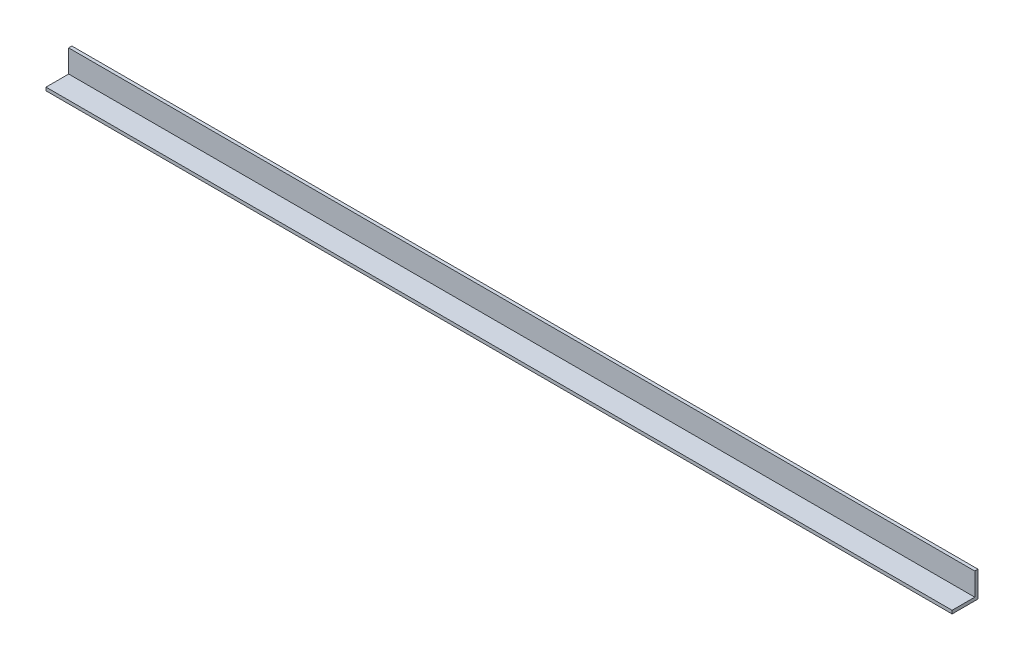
ISO-10303-21;
HEADER;
FILE_DESCRIPTION(('STEP AP214'),'2;1');
FILE_NAME('part.step','',(''),(''),'','','');
FILE_SCHEMA(('AUTOMOTIVE_DESIGN { 1 0 10303 214 1 1 1 1 }'));
ENDSEC;
DATA;
#1=APPLICATION_CONTEXT('core data for automotive mechanical design processes');
#2=APPLICATION_PROTOCOL_DEFINITION('international standard','automotive_design',2000,#1);
#3=PRODUCT_CONTEXT('',#1,'mechanical');
#4=PRODUCT('Part','Part','',(#3));
#5=PRODUCT_RELATED_PRODUCT_CATEGORY('part','',(#4));
#6=PRODUCT_DEFINITION_FORMATION('','',#4);
#7=PRODUCT_DEFINITION_CONTEXT('part definition',#1,'design');
#8=PRODUCT_DEFINITION('design','',#6,#7);
#9=PRODUCT_DEFINITION_SHAPE('','',#8);
#10=(LENGTH_UNIT() NAMED_UNIT(*) SI_UNIT(.MILLI.,.METRE.));
#11=(NAMED_UNIT(*) PLANE_ANGLE_UNIT() SI_UNIT($,.RADIAN.));
#12=(NAMED_UNIT(*) SI_UNIT($,.STERADIAN.) SOLID_ANGLE_UNIT());
#13=UNCERTAINTY_MEASURE_WITH_UNIT(LENGTH_MEASURE(1.E-05),#10,'distance_accuracy_value','');
#14=(GEOMETRIC_REPRESENTATION_CONTEXT(3) GLOBAL_UNCERTAINTY_ASSIGNED_CONTEXT((#13)) GLOBAL_UNIT_ASSIGNED_CONTEXT((#10,
#11,#12)) REPRESENTATION_CONTEXT('',''));
#15=CARTESIAN_POINT('',(0.,0.,0.));
#16=DIRECTION('',(0.,0.,1.));
#17=DIRECTION('',(1.,0.,0.));
#18=AXIS2_PLACEMENT_3D('',#15,#16,#17);
#19=CARTESIAN_POINT('',(444.5,3.175,-12.7));
#20=DIRECTION('',(-1.,0.,0.));
#21=DIRECTION('',(0.,0.,1.));
#22=AXIS2_PLACEMENT_3D('',#19,#20,#21);
#23=PLANE('',#22);
#24=DIRECTION('',(0.,0.,-1.));
#25=VECTOR('',#24,1.);
#26=CARTESIAN_POINT('',(444.5,0.,-12.7));
#27=LINE('',#26,#25);
#28=CARTESIAN_POINT('',(444.5,0.,12.7));
#29=VERTEX_POINT('',#28);
#30=CARTESIAN_POINT('',(444.5,0.,-12.7));
#31=VERTEX_POINT('',#30);
#32=EDGE_CURVE('E90',#29,#31,#27,.T.);
#33=ORIENTED_EDGE('',*,*,#32,.T.);
#34=DIRECTION('',(0.,-1.,0.));
#35=VECTOR('',#34,1.);
#36=CARTESIAN_POINT('',(444.5,3.175,-12.7));
#37=LINE('',#36,#35);
#38=CARTESIAN_POINT('',(444.5,25.4,-12.7));
#39=VERTEX_POINT('',#38);
#40=EDGE_CURVE('E11',#39,#31,#37,.T.);
#41=ORIENTED_EDGE('',*,*,#40,.F.);
#42=DIRECTION('',(0.,0.,-1.));
#43=VECTOR('',#42,1.);
#44=CARTESIAN_POINT('',(444.5,25.4,-9.525));
#45=LINE('',#44,#43);
#46=CARTESIAN_POINT('',(444.5,25.4,-9.525));
#47=VERTEX_POINT('',#46);
#48=EDGE_CURVE('E116',#47,#39,#45,.T.);
#49=ORIENTED_EDGE('',*,*,#48,.F.);
#50=DIRECTION('',(0.,-1.,0.));
#51=VECTOR('',#50,1.);
#52=CARTESIAN_POINT('',(444.5,25.4,-9.525));
#53=LINE('',#52,#51);
#54=CARTESIAN_POINT('',(444.5,3.175,-9.525));
#55=VERTEX_POINT('',#54);
#56=EDGE_CURVE('E99',#47,#55,#53,.T.);
#57=ORIENTED_EDGE('',*,*,#56,.T.);
#58=DIRECTION('',(0.,0.,-1.));
#59=VECTOR('',#58,1.);
#60=CARTESIAN_POINT('',(444.5,3.175,-12.7));
#61=LINE('',#60,#59);
#62=CARTESIAN_POINT('',(444.5,3.175,12.7));
#63=VERTEX_POINT('',#62);
#64=EDGE_CURVE('E84',#63,#55,#61,.T.);
#65=ORIENTED_EDGE('',*,*,#64,.F.);
#66=DIRECTION('',(0.,-1.,0.));
#67=VECTOR('',#66,1.);
#68=CARTESIAN_POINT('',(444.5,3.175,12.7));
#69=LINE('',#68,#67);
#70=EDGE_CURVE('E77',#63,#29,#69,.T.);
#71=ORIENTED_EDGE('',*,*,#70,.T.);
#72=EDGE_LOOP('',(#33,#41,#49,#57,#65,#71));
#73=FACE_BOUND('',#72,.T.);
#74=ADVANCED_FACE('F33',(#73),#23,.F.);
#75=CARTESIAN_POINT('',(-444.5,3.175,-12.7));
#76=DIRECTION('',(0.,0.,1.));
#77=DIRECTION('',(1.,0.,0.));
#78=AXIS2_PLACEMENT_3D('',#75,#76,#77);
#79=PLANE('',#78);
#80=DIRECTION('',(-1.,0.,0.));
#81=VECTOR('',#80,1.);
#82=CARTESIAN_POINT('',(-444.5,0.,-12.7));
#83=LINE('',#82,#81);
#84=CARTESIAN_POINT('',(-444.5,0.,-12.7));
#85=VERTEX_POINT('',#84);
#86=EDGE_CURVE('E94',#31,#85,#83,.T.);
#87=ORIENTED_EDGE('',*,*,#86,.T.);
#88=DIRECTION('',(0.,-1.,0.));
#89=VECTOR('',#88,1.);
#90=CARTESIAN_POINT('',(-444.5,3.175,-12.7));
#91=LINE('',#90,#89);
#92=CARTESIAN_POINT('',(-444.5,25.4,-12.7));
#93=VERTEX_POINT('',#92);
#94=EDGE_CURVE('E41',#93,#85,#91,.T.);
#95=ORIENTED_EDGE('',*,*,#94,.F.);
#96=DIRECTION('',(-1.,0.,0.));
#97=VECTOR('',#96,1.);
#98=CARTESIAN_POINT('',(444.5,25.4,-12.7));
#99=LINE('',#98,#97);
#100=EDGE_CURVE('E119',#39,#93,#99,.T.);
#101=ORIENTED_EDGE('',*,*,#100,.F.);
#102=ORIENTED_EDGE('',*,*,#40,.T.);
#103=EDGE_LOOP('',(#87,#95,#101,#102));
#104=FACE_BOUND('',#103,.T.);
#105=ADVANCED_FACE('F145',(#104),#79,.F.);
#106=CARTESIAN_POINT('',(-444.5,3.175,-12.7));
#107=DIRECTION('',(1.,0.,0.));
#108=DIRECTION('',(0.,0.,-1.));
#109=AXIS2_PLACEMENT_3D('',#106,#107,#108);
#110=PLANE('',#109);
#111=DIRECTION('',(0.,0.,1.));
#112=VECTOR('',#111,1.);
#113=CARTESIAN_POINT('',(-444.5,0.,-12.7));
#114=LINE('',#113,#112);
#115=CARTESIAN_POINT('',(-444.5,0.,12.7));
#116=VERTEX_POINT('',#115);
#117=EDGE_CURVE('E85',#85,#116,#114,.T.);
#118=ORIENTED_EDGE('',*,*,#117,.T.);
#119=DIRECTION('',(0.,-1.,0.));
#120=VECTOR('',#119,1.);
#121=CARTESIAN_POINT('',(-444.5,3.175,12.7));
#122=LINE('',#121,#120);
#123=CARTESIAN_POINT('',(-444.5,3.175,12.7));
#124=VERTEX_POINT('',#123);
#125=EDGE_CURVE('E80',#124,#116,#122,.T.);
#126=ORIENTED_EDGE('',*,*,#125,.F.);
#127=DIRECTION('',(0.,0.,1.));
#128=VECTOR('',#127,1.);
#129=CARTESIAN_POINT('',(-444.5,3.175,-12.7));
#130=LINE('',#129,#128);
#131=CARTESIAN_POINT('',(-444.5,3.175,-9.525));
#132=VERTEX_POINT('',#131);
#133=EDGE_CURVE('E109',#132,#124,#130,.T.);
#134=ORIENTED_EDGE('',*,*,#133,.F.);
#135=DIRECTION('',(0.,-1.,0.));
#136=VECTOR('',#135,1.);
#137=CARTESIAN_POINT('',(-444.5,25.4,-9.525));
#138=LINE('',#137,#136);
#139=CARTESIAN_POINT('',(-444.5,25.4,-9.525));
#140=VERTEX_POINT('',#139);
#141=EDGE_CURVE('E95',#140,#132,#138,.T.);
#142=ORIENTED_EDGE('',*,*,#141,.F.);
#143=DIRECTION('',(0.,0.,1.));
#144=VECTOR('',#143,1.);
#145=CARTESIAN_POINT('',(-444.5,25.4,-12.7));
#146=LINE('',#145,#144);
#147=EDGE_CURVE('E131',#93,#140,#146,.T.);
#148=ORIENTED_EDGE('',*,*,#147,.F.);
#149=ORIENTED_EDGE('',*,*,#94,.T.);
#150=EDGE_LOOP('',(#118,#126,#134,#142,#148,#149));
#151=FACE_BOUND('',#150,.T.);
#152=ADVANCED_FACE('F153',(#151),#110,.F.);
#153=CARTESIAN_POINT('',(-444.5,3.175,12.7));
#154=DIRECTION('',(0.,0.,-1.));
#155=DIRECTION('',(-1.,0.,0.));
#156=AXIS2_PLACEMENT_3D('',#153,#154,#155);
#157=PLANE('',#156);
#158=DIRECTION('',(1.,0.,0.));
#159=VECTOR('',#158,1.);
#160=CARTESIAN_POINT('',(-444.5,0.,12.7));
#161=LINE('',#160,#159);
#162=EDGE_CURVE('E74',#116,#29,#161,.T.);
#163=ORIENTED_EDGE('',*,*,#162,.T.);
#164=ORIENTED_EDGE('',*,*,#70,.F.);
#165=DIRECTION('',(1.,0.,0.));
#166=VECTOR('',#165,1.);
#167=CARTESIAN_POINT('',(-444.5,3.175,12.7));
#168=LINE('',#167,#166);
#169=EDGE_CURVE('E55',#124,#63,#168,.T.);
#170=ORIENTED_EDGE('',*,*,#169,.F.);
#171=ORIENTED_EDGE('',*,*,#125,.T.);
#172=EDGE_LOOP('',(#163,#164,#170,#171));
#173=FACE_BOUND('',#172,.T.);
#174=ADVANCED_FACE('F76',(#173),#157,.F.);
#175=CARTESIAN_POINT('',(444.5,3.175,12.7));
#176=DIRECTION('',(0.,1.,0.));
#177=DIRECTION('',(0.,0.,1.));
#178=AXIS2_PLACEMENT_3D('',#175,#176,#177);
#179=PLANE('',#178);
#180=DIRECTION('',(1.,0.,0.));
#181=VECTOR('',#180,1.);
#182=CARTESIAN_POINT('',(-444.5,3.175,-9.525));
#183=LINE('',#182,#181);
#184=EDGE_CURVE('E49',#132,#55,#183,.T.);
#185=ORIENTED_EDGE('',*,*,#184,.F.);
#186=ORIENTED_EDGE('',*,*,#133,.T.);
#187=ORIENTED_EDGE('',*,*,#169,.T.);
#188=ORIENTED_EDGE('',*,*,#64,.T.);
#189=EDGE_LOOP('',(#185,#186,#187,#188));
#190=FACE_BOUND('',#189,.T.);
#191=ADVANCED_FACE('F149',(#190),#179,.T.);
#192=CARTESIAN_POINT('',(444.5,0.,12.7));
#193=DIRECTION('',(0.,1.,0.));
#194=DIRECTION('',(0.,0.,1.));
#195=AXIS2_PLACEMENT_3D('',#192,#193,#194);
#196=PLANE('',#195);
#197=ORIENTED_EDGE('',*,*,#32,.F.);
#198=ORIENTED_EDGE('',*,*,#162,.F.);
#199=ORIENTED_EDGE('',*,*,#117,.F.);
#200=ORIENTED_EDGE('',*,*,#86,.F.);
#201=EDGE_LOOP('',(#197,#198,#199,#200));
#202=FACE_BOUND('',#201,.T.);
#203=ADVANCED_FACE('F93',(#202),#196,.F.);
#204=CARTESIAN_POINT('',(-444.5,25.4,-9.525));
#205=DIRECTION('',(0.,0.,-1.));
#206=DIRECTION('',(-1.,0.,0.));
#207=AXIS2_PLACEMENT_3D('',#204,#205,#206);
#208=PLANE('',#207);
#209=ORIENTED_EDGE('',*,*,#184,.T.);
#210=ORIENTED_EDGE('',*,*,#56,.F.);
#211=DIRECTION('',(1.,0.,0.));
#212=VECTOR('',#211,1.);
#213=CARTESIAN_POINT('',(-444.5,25.4,-9.525));
#214=LINE('',#213,#212);
#215=EDGE_CURVE('E126',#140,#47,#214,.T.);
#216=ORIENTED_EDGE('',*,*,#215,.F.);
#217=ORIENTED_EDGE('',*,*,#141,.T.);
#218=EDGE_LOOP('',(#209,#210,#216,#217));
#219=FACE_BOUND('',#218,.T.);
#220=ADVANCED_FACE('F151',(#219),#208,.F.);
#221=CARTESIAN_POINT('',(-444.5,25.4,-12.7));
#222=DIRECTION('',(0.,1.,0.));
#223=DIRECTION('',(0.,0.,1.));
#224=AXIS2_PLACEMENT_3D('',#221,#222,#223);
#225=PLANE('',#224);
#226=ORIENTED_EDGE('',*,*,#100,.T.);
#227=ORIENTED_EDGE('',*,*,#147,.T.);
#228=ORIENTED_EDGE('',*,*,#215,.T.);
#229=ORIENTED_EDGE('',*,*,#48,.T.);
#230=EDGE_LOOP('',(#226,#227,#228,#229));
#231=FACE_BOUND('',#230,.T.);
#232=ADVANCED_FACE('F138',(#231),#225,.T.);
#233=CLOSED_SHELL('',(#74,#105,#152,#174,#191,#203,#220,#232));
#234=MANIFOLD_SOLID_BREP('B2',#233);
#235=ADVANCED_BREP_SHAPE_REPRESENTATION('',(#18,#234),#14);
#236=SHAPE_DEFINITION_REPRESENTATION(#9,#235);
ENDSEC;
END-ISO-10303-21;
